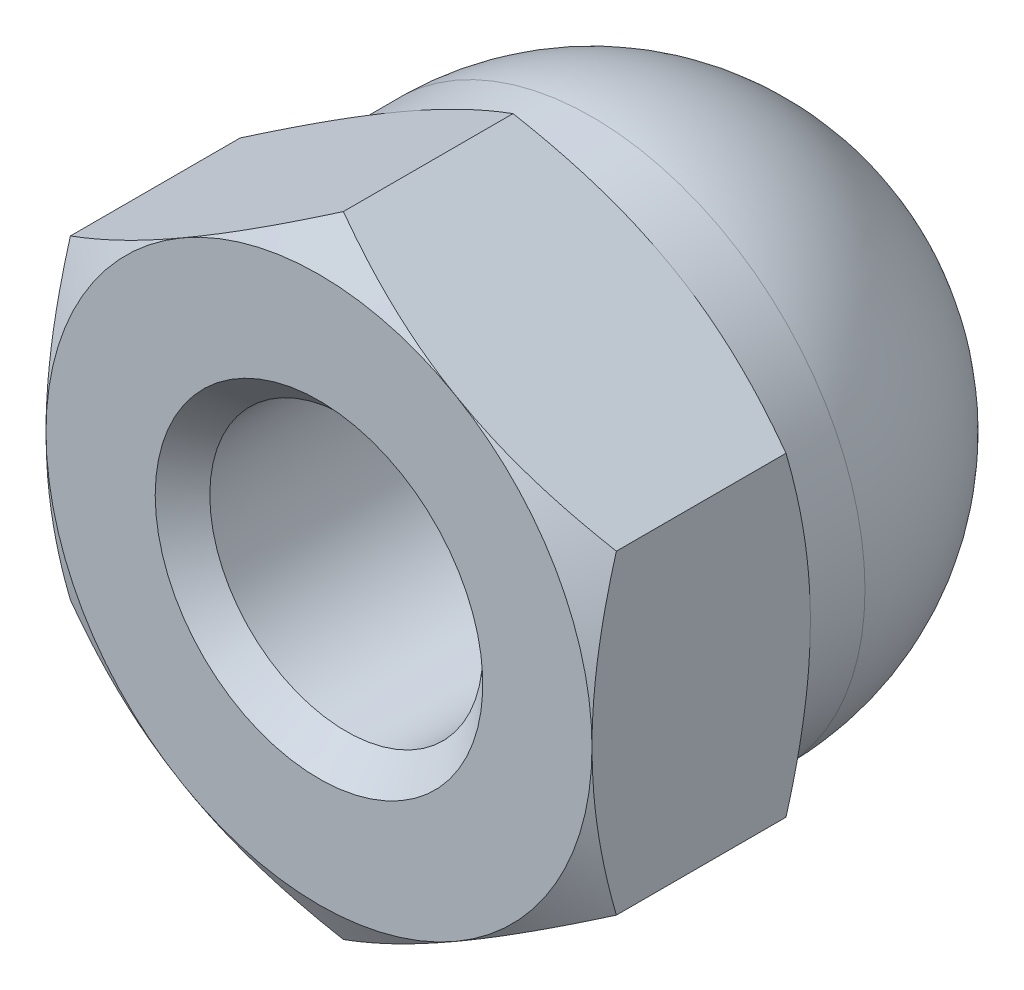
ISO-10303-21;
HEADER;
FILE_DESCRIPTION(('STEP AP214'),'2;1');
FILE_NAME('part.step','',(''),(''),'','','');
FILE_SCHEMA(('AUTOMOTIVE_DESIGN { 1 0 10303 214 1 1 1 1 }'));
ENDSEC;
DATA;
#1=APPLICATION_CONTEXT('core data for automotive mechanical design processes');
#2=APPLICATION_PROTOCOL_DEFINITION('international standard','automotive_design',2000,#1);
#3=PRODUCT_CONTEXT('',#1,'mechanical');
#4=PRODUCT('Part','Part','',(#3));
#5=PRODUCT_RELATED_PRODUCT_CATEGORY('part','',(#4));
#6=PRODUCT_DEFINITION_FORMATION('','',#4);
#7=PRODUCT_DEFINITION_CONTEXT('part definition',#1,'design');
#8=PRODUCT_DEFINITION('design','',#6,#7);
#9=PRODUCT_DEFINITION_SHAPE('','',#8);
#10=(LENGTH_UNIT() NAMED_UNIT(*) SI_UNIT(.MILLI.,.METRE.));
#11=(NAMED_UNIT(*) PLANE_ANGLE_UNIT() SI_UNIT($,.RADIAN.));
#12=(NAMED_UNIT(*) SI_UNIT($,.STERADIAN.) SOLID_ANGLE_UNIT());
#13=UNCERTAINTY_MEASURE_WITH_UNIT(LENGTH_MEASURE(1.E-05),#10,'distance_accuracy_value','');
#14=(GEOMETRIC_REPRESENTATION_CONTEXT(3) GLOBAL_UNCERTAINTY_ASSIGNED_CONTEXT((#13)) GLOBAL_UNIT_ASSIGNED_CONTEXT((#10,
#11,#12)) REPRESENTATION_CONTEXT('',''));
#15=CARTESIAN_POINT('',(0.,0.,0.));
#16=DIRECTION('',(0.,0.,1.));
#17=DIRECTION('',(1.,0.,0.));
#18=AXIS2_PLACEMENT_3D('',#15,#16,#17);
#19=CARTESIAN_POINT('',(-5.,8.66025403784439,0.));
#20=DIRECTION('',(0.,0.,-1.));
#21=DIRECTION('',(-1.,0.,0.));
#22=AXIS2_PLACEMENT_3D('',#19,#20,#21);
#23=PLANE('',#22);
#24=CARTESIAN_POINT('',(0.,0.,0.));
#25=DIRECTION('',(0.,0.,-1.));
#26=DIRECTION('',(-1.,0.,0.));
#27=AXIS2_PLACEMENT_3D('',#24,#25,#26);
#28=CIRCLE('',#27,3.);
#29=CARTESIAN_POINT('',(-3.,0.,0.));
#30=VERTEX_POINT('',#29);
#31=EDGE_CURVE('E11',#30,#30,#28,.T.);
#32=ORIENTED_EDGE('',*,*,#31,.T.);
#33=EDGE_LOOP('',(#32));
#34=FACE_BOUND('',#33,.T.);
#35=CARTESIAN_POINT('',(0.,0.,0.));
#36=DIRECTION('',(0.,0.,-1.));
#37=DIRECTION('',(-1.,0.,0.));
#38=AXIS2_PLACEMENT_3D('',#35,#36,#37);
#39=CIRCLE('',#38,5.);
#40=CARTESIAN_POINT('',(-5.,0.,0.));
#41=VERTEX_POINT('',#40);
#42=CARTESIAN_POINT('',(-2.5,4.3301270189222,0.));
#43=VERTEX_POINT('',#42);
#44=EDGE_CURVE('E163',#41,#43,#39,.T.);
#45=ORIENTED_EDGE('',*,*,#44,.F.);
#46=CARTESIAN_POINT('',(0.,0.,0.));
#47=DIRECTION('',(0.,0.,-1.));
#48=DIRECTION('',(-1.,0.,0.));
#49=AXIS2_PLACEMENT_3D('',#46,#47,#48);
#50=CIRCLE('',#49,5.);
#51=CARTESIAN_POINT('',(-2.5,-4.3301270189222,0.));
#52=VERTEX_POINT('',#51);
#53=EDGE_CURVE('E150',#41,#52,#50,.F.);
#54=ORIENTED_EDGE('',*,*,#53,.T.);
#55=CARTESIAN_POINT('',(2.5,-4.3301270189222,0.));
#56=VERTEX_POINT('',#55);
#57=EDGE_CURVE('E303',#52,#56,#50,.F.);
#58=ORIENTED_EDGE('',*,*,#57,.T.);
#59=CARTESIAN_POINT('',(5.,0.,0.));
#60=VERTEX_POINT('',#59);
#61=EDGE_CURVE('E377',#56,#60,#50,.F.);
#62=ORIENTED_EDGE('',*,*,#61,.T.);
#63=CARTESIAN_POINT('',(2.5,4.3301270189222,0.));
#64=VERTEX_POINT('',#63);
#65=EDGE_CURVE('E378',#60,#64,#50,.F.);
#66=ORIENTED_EDGE('',*,*,#65,.T.);
#67=EDGE_CURVE('E279',#64,#43,#50,.F.);
#68=ORIENTED_EDGE('',*,*,#67,.T.);
#69=EDGE_LOOP('',(#45,#54,#58,#62,#66,#68));
#70=FACE_BOUND('',#69,.T.);
#71=ADVANCED_FACE('F37',(#34,#70),#23,.F.);
#72=CARTESIAN_POINT('',(0.,0.,0.));
#73=DIRECTION('',(0.,0.,-1.));
#74=DIRECTION('',(-1.,0.,0.));
#75=AXIS2_PLACEMENT_3D('',#72,#73,#74);
#76=CONICAL_SURFACE('',#75,5.,1.0471975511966);
#77=CARTESIAN_POINT('',(-5.,-7.87365701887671,-2.49824245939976));
#78=CARTESIAN_POINT('',(-5.,-7.65424885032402,-2.39133489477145));
#79=CARTESIAN_POINT('',(-5.,-7.43434967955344,-2.28541837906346));
#80=CARTESIAN_POINT('',(-5.,-6.99330867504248,-2.07612251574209));
#81=CARTESIAN_POINT('',(-5.,-6.77216666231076,-1.97274354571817));
#82=CARTESIAN_POINT('',(-5.,-6.32729608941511,-1.76858296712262));
#83=CARTESIAN_POINT('',(-5.,-6.10356006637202,-1.66781756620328));
#84=CARTESIAN_POINT('',(-5.,-5.6543498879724,-1.47025361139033));
#85=CARTESIAN_POINT('',(-5.,-5.42887581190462,-1.37345487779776));
#86=CARTESIAN_POINT('',(-5.,-4.9680971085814,-1.1816480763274));
#87=CARTESIAN_POINT('',(-5.,-4.73271967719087,-1.08681398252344));
#88=CARTESIAN_POINT('',(-5.,-4.25925541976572,-0.904038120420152));
#89=CARTESIAN_POINT('',(-5.,-4.02116829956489,-0.8160971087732));
#90=CARTESIAN_POINT('',(-5.,-3.54231432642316,-0.649328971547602));
#91=CARTESIAN_POINT('',(-5.,-3.30155361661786,-0.570484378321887));
#92=CARTESIAN_POINT('',(-5.,-2.81658011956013,-0.424359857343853));
#93=CARTESIAN_POINT('',(-5.,-2.57236840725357,-0.357076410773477));
#94=CARTESIAN_POINT('',(-5.,-2.08174046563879,-0.237589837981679));
#95=CARTESIAN_POINT('',(-5.,-1.83534566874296,-0.18530029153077));
#96=CARTESIAN_POINT('',(-5.,-1.33936997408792,-0.0986667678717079));
#97=CARTESIAN_POINT('',(-5.,-1.08978941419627,-0.0643209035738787));
#98=CARTESIAN_POINT('',(-5.,-0.591995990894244,-0.0167583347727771));
#99=CARTESIAN_POINT('',(-5.,-0.343810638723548,-0.00326081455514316));
#100=CARTESIAN_POINT('',(-5.,0.15282167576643,0.00220791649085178));
#101=CARTESIAN_POINT('',(-5.,0.401268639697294,-0.00582100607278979));
#102=CARTESIAN_POINT('',(-5.,0.819594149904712,-0.0368840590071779));
#103=CARTESIAN_POINT('',(-5.,0.989903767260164,-0.0544819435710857));
#104=CARTESIAN_POINT('',(-5.,1.32934599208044,-0.0987603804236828));
#105=CARTESIAN_POINT('',(-5.,1.49847844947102,-0.125442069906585));
#106=CARTESIAN_POINT('',(-5.,2.00384655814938,-0.217717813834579));
#107=CARTESIAN_POINT('',(-5.,2.33788035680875,-0.295527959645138));
#108=CARTESIAN_POINT('',(-5.,2.83751062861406,-0.431339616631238));
#109=CARTESIAN_POINT('',(-5.,3.00567281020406,-0.480447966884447));
#110=CARTESIAN_POINT('',(-5.,3.34036615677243,-0.583987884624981));
#111=CARTESIAN_POINT('',(-5.,3.506897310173,-0.638419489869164));
#112=CARTESIAN_POINT('',(-5.,3.83837706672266,-0.751714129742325));
#113=CARTESIAN_POINT('',(-5.,4.00332611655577,-0.810575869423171));
#114=CARTESIAN_POINT('',(-5.,4.33184285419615,-0.932016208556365));
#115=CARTESIAN_POINT('',(-5.,4.49541056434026,-0.994594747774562));
#116=CARTESIAN_POINT('',(-5.,4.90340399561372,-1.15516084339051));
#117=CARTESIAN_POINT('',(-5.,5.14705792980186,-1.25510669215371));
#118=CARTESIAN_POINT('',(-5.,5.63208625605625,-1.46040212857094));
#119=CARTESIAN_POINT('',(-5.,5.87346045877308,-1.56575216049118));
#120=CARTESIAN_POINT('',(-5.,6.35438607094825,-1.78069088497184));
#121=CARTESIAN_POINT('',(-5.,6.59393697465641,-1.89028070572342));
#122=CARTESIAN_POINT('',(-5.,7.07149214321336,-2.11278643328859));
#123=CARTESIAN_POINT('',(-5.,7.3094963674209,-2.22570242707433));
#124=CARTESIAN_POINT('',(-5.,7.78453532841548,-2.45433961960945));
#125=CARTESIAN_POINT('',(-5.,8.02156838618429,-2.57006430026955));
#126=CARTESIAN_POINT('',(-5.,8.49456959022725,-2.80367203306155));
#127=CARTESIAN_POINT('',(-5.,8.73053772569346,-2.92155510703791));
#128=CARTESIAN_POINT('',(-5.,9.43703462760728,-3.27778987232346));
#129=CARTESIAN_POINT('',(-5.,9.90623897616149,-3.51876746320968));
#130=CARTESIAN_POINT('',(-5.,10.7985198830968,-3.9828522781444));
#131=CARTESIAN_POINT('',(-5.,11.2218199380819,-4.20553183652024));
#132=CARTESIAN_POINT('',(-5.,12.0668775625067,-4.65384433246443));
#133=CARTESIAN_POINT('',(-5.,12.4886350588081,-4.8794774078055));
#134=CARTESIAN_POINT('',(-5.,13.3297110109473,-5.33229431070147));
#135=CARTESIAN_POINT('',(-5.,13.7490329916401,-5.55947160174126));
#136=CARTESIAN_POINT('',(-5.,14.5867026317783,-6.01555026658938));
#137=CARTESIAN_POINT('',(-5.,15.0050503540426,-6.24445152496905));
#138=CARTESIAN_POINT('',(-5.,15.4230465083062,-6.47398871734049));
#139=B_SPLINE_CURVE_WITH_KNOTS('',3,(#77,#78,#79,#80,#81,#82,#83,#84,#85,#86,#87,#88,#89,#90,
#91,#92,#93,#94,#95,#96,#97,#98,#99,#100,#101,#102,#103,#104,#105,#106,#107,#108,#109,#110,#111,
#112,#113,#114,#115,#116,#117,#118,#119,#120,#121,#122,#123,#124,#125,#126,#127,#128,#129,#130,
#131,#132,#133,#134,#135,#136,#137,#138),.UNSPECIFIED.,.F.,.F.,(4,2,2,2,2,2,2,2,2,2,2,2,2,2,2,2,
2,2,2,2,2,2,2,2,2,2,2,2,2,2,4),(0.,0.732212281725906,1.46453286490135,2.20064275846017,
2.9367192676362,3.69792700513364,4.45921818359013,5.21902224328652,5.97859463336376,
6.73369679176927,7.48871952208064,8.23348098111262,8.97824705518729,9.49164933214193,
10.0051159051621,11.0325662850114,11.5580766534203,12.0835907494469,12.6089518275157,
13.1343043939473,13.9242808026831,14.7143222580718,15.5045754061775,16.2948492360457,
17.0861585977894,17.8774759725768,19.4598336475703,20.8947158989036,22.3296653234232,
23.760382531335,25.1910047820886),.UNSPECIFIED.);
#140=CARTESIAN_POINT('',(-5.,2.88675134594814,-0.446581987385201));
#141=VERTEX_POINT('',#140);
#142=EDGE_CURVE('E181',#141,#41,#139,.F.);
#143=ORIENTED_EDGE('',*,*,#142,.T.);
#144=ORIENTED_EDGE('',*,*,#44,.T.);
#145=CARTESIAN_POINT('',(0.0002,5.7736181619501,-0.446648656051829));
#146=CARTESIAN_POINT('',(-0.219534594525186,5.64675433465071,-0.373386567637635));
#147=CARTESIAN_POINT('',(-0.441148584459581,5.5188054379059,-0.306751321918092));
#148=CARTESIAN_POINT('',(-0.888213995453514,5.26069210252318,-0.190438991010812));
#149=CARTESIAN_POINT('',(-1.11367335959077,5.13052307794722,-0.140803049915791));
#150=CARTESIAN_POINT('',(-1.56183230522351,4.87177839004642,-0.0635510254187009));
#151=CARTESIAN_POINT('',(-1.78446209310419,4.74324302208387,-0.0354203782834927));
#152=CARTESIAN_POINT('',(-2.11918990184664,4.54998783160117,-0.0101949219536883));
#153=CARTESIAN_POINT('',(-2.23084219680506,4.48552534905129,-0.00461345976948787));
#154=CARTESIAN_POINT('',(-2.4542499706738,4.35654081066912,0.000797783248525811));
#155=CARTESIAN_POINT('',(-2.56600544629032,4.29201875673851,0.000627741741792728));
#156=CARTESIAN_POINT('',(-2.87218423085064,4.11524635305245,-0.00775363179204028));
#157=CARTESIAN_POINT('',(-3.06650608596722,4.00305457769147,-0.0218297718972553));
#158=CARTESIAN_POINT('',(-3.45386010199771,3.77941563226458,-0.0664652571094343));
#159=CARTESIAN_POINT('',(-3.64689090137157,3.66796924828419,-0.0970398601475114));
#160=CARTESIAN_POINT('',(-4.03502534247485,3.44387972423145,-0.173468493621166));
#161=CARTESIAN_POINT('',(-4.23007999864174,3.33126486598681,-0.219646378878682));
#162=CARTESIAN_POINT('',(-4.61728034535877,3.10771464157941,-0.324451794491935));
#163=CARTESIAN_POINT('',(-4.80943099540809,2.99677641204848,-0.383054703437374));
#164=CARTESIAN_POINT('',(-5.0002,2.8866358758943,-0.446648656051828));
#165=B_SPLINE_CURVE_WITH_KNOTS('',3,(#145,#146,#147,#148,#149,#150,#151,#152,#153,#154,#155,
#156,#157,#158,#159,#160,#161,#162,#163,#164),.UNSPECIFIED.,.F.,.F.,(4,2,2,2,2,2,2,2,2,4),(0.,
0.79255584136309,1.58701660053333,2.3618153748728,2.74884076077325,3.13585419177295,
3.80962362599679,4.48401723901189,5.17336882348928,5.86136694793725),.UNSPECIFIED.);
#166=EDGE_CURVE('E167',#43,#141,#165,.T.);
#167=ORIENTED_EDGE('',*,*,#166,.T.);
#168=EDGE_LOOP('',(#143,#144,#167));
#169=FACE_BOUND('',#168,.T.);
#170=ADVANCED_FACE('F188',(#169),#76,.T.);
#171=CARTESIAN_POINT('',(5.0002,2.8866358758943,-0.446648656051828));
#172=CARTESIAN_POINT('',(4.78046540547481,3.01349970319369,-0.373386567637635));
#173=CARTESIAN_POINT('',(4.55885141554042,3.1414485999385,-0.306751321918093));
#174=CARTESIAN_POINT('',(4.11178600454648,3.39956193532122,-0.190438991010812));
#175=CARTESIAN_POINT('',(3.88632664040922,3.52973095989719,-0.140803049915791));
#176=CARTESIAN_POINT('',(3.43816769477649,3.78847564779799,-0.0635510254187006));
#177=CARTESIAN_POINT('',(3.21553790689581,3.91701101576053,-0.0354203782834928));
#178=CARTESIAN_POINT('',(2.88081009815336,4.11026620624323,-0.0101949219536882));
#179=CARTESIAN_POINT('',(2.76915780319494,4.17472868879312,-0.00461345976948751));
#180=CARTESIAN_POINT('',(2.5457500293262,4.30371322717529,0.000797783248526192));
#181=CARTESIAN_POINT('',(2.43399455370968,4.3682352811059,0.000627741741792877));
#182=CARTESIAN_POINT('',(2.12781576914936,4.54500768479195,-0.00775363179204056));
#183=CARTESIAN_POINT('',(1.93349391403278,4.65719946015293,-0.0218297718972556));
#184=CARTESIAN_POINT('',(1.54613989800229,4.88083840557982,-0.0664652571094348));
#185=CARTESIAN_POINT('',(1.35310909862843,4.99228478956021,-0.0970398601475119));
#186=CARTESIAN_POINT('',(0.964974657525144,5.21637431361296,-0.173468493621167));
#187=CARTESIAN_POINT('',(0.769920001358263,5.32898917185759,-0.219646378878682));
#188=CARTESIAN_POINT('',(0.382719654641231,5.55253939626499,-0.324451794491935));
#189=CARTESIAN_POINT('',(0.190569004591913,5.66347762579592,-0.383054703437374));
#190=CARTESIAN_POINT('',(-0.000200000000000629,5.7736181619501,-0.446648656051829));
#191=B_SPLINE_CURVE_WITH_KNOTS('',3,(#171,#172,#173,#174,#175,#176,#177,#178,#179,#180,#181,
#182,#183,#184,#185,#186,#187,#188,#189,#190),.UNSPECIFIED.,.F.,.F.,(4,2,2,2,2,2,2,2,2,4),(0.,
0.792555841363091,1.58701660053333,2.36181537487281,2.74884076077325,3.13585419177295,
3.80962362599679,4.48401723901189,5.17336882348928,5.86136694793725),.UNSPECIFIED.);
#192=CARTESIAN_POINT('',(0.,5.77350269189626,-0.446581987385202));
#193=VERTEX_POINT('',#192);
#194=EDGE_CURVE('E206',#64,#193,#191,.T.);
#195=ORIENTED_EDGE('',*,*,#194,.T.);
#196=EDGE_CURVE('E180',#193,#43,#165,.T.);
#197=ORIENTED_EDGE('',*,*,#196,.T.);
#198=ORIENTED_EDGE('',*,*,#67,.F.);
#199=EDGE_LOOP('',(#195,#197,#198));
#200=FACE_BOUND('',#199,.T.);
#201=ADVANCED_FACE('F193',(#200),#76,.T.);
#202=CARTESIAN_POINT('',(5.,-7.87365701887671,-2.49824245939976));
#203=CARTESIAN_POINT('',(5.,-7.65424885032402,-2.39133489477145));
#204=CARTESIAN_POINT('',(5.,-7.43434967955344,-2.28541837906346));
#205=CARTESIAN_POINT('',(5.,-6.99330867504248,-2.07612251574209));
#206=CARTESIAN_POINT('',(5.,-6.77216666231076,-1.97274354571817));
#207=CARTESIAN_POINT('',(5.,-6.32729608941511,-1.76858296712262));
#208=CARTESIAN_POINT('',(5.,-6.10356006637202,-1.66781756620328));
#209=CARTESIAN_POINT('',(5.,-5.6543498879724,-1.47025361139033));
#210=CARTESIAN_POINT('',(5.,-5.42887581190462,-1.37345487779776));
#211=CARTESIAN_POINT('',(5.,-4.9680971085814,-1.1816480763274));
#212=CARTESIAN_POINT('',(5.,-4.73271967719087,-1.08681398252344));
#213=CARTESIAN_POINT('',(5.,-4.25925541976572,-0.904038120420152));
#214=CARTESIAN_POINT('',(5.,-4.02116829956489,-0.8160971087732));
#215=CARTESIAN_POINT('',(5.,-3.54231432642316,-0.649328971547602));
#216=CARTESIAN_POINT('',(5.,-3.30155361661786,-0.570484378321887));
#217=CARTESIAN_POINT('',(5.,-2.81658011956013,-0.424359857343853));
#218=CARTESIAN_POINT('',(5.,-2.57236840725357,-0.357076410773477));
#219=CARTESIAN_POINT('',(5.,-2.08174046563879,-0.237589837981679));
#220=CARTESIAN_POINT('',(5.,-1.83534566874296,-0.18530029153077));
#221=CARTESIAN_POINT('',(5.,-1.33936997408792,-0.0986667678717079));
#222=CARTESIAN_POINT('',(5.,-1.08978941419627,-0.0643209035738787));
#223=CARTESIAN_POINT('',(5.,-0.591995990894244,-0.0167583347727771));
#224=CARTESIAN_POINT('',(5.,-0.343810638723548,-0.00326081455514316));
#225=CARTESIAN_POINT('',(5.,0.15282167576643,0.00220791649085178));
#226=CARTESIAN_POINT('',(5.,0.401268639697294,-0.00582100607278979));
#227=CARTESIAN_POINT('',(5.,0.819594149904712,-0.0368840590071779));
#228=CARTESIAN_POINT('',(5.,0.989903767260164,-0.0544819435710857));
#229=CARTESIAN_POINT('',(5.,1.32934599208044,-0.0987603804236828));
#230=CARTESIAN_POINT('',(5.,1.49847844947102,-0.125442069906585));
#231=CARTESIAN_POINT('',(5.,2.00384655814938,-0.217717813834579));
#232=CARTESIAN_POINT('',(5.,2.33788035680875,-0.295527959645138));
#233=CARTESIAN_POINT('',(5.,2.83751062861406,-0.431339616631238));
#234=CARTESIAN_POINT('',(5.,3.00567281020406,-0.480447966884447));
#235=CARTESIAN_POINT('',(5.,3.34036615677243,-0.583987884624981));
#236=CARTESIAN_POINT('',(5.,3.506897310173,-0.638419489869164));
#237=CARTESIAN_POINT('',(5.,3.83837706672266,-0.751714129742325));
#238=CARTESIAN_POINT('',(5.,4.00332611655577,-0.810575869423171));
#239=CARTESIAN_POINT('',(5.,4.33184285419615,-0.932016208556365));
#240=CARTESIAN_POINT('',(5.,4.49541056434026,-0.994594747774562));
#241=CARTESIAN_POINT('',(5.,4.90340399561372,-1.15516084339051));
#242=CARTESIAN_POINT('',(5.,5.14705792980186,-1.25510669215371));
#243=CARTESIAN_POINT('',(5.,5.63208625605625,-1.46040212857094));
#244=CARTESIAN_POINT('',(5.,5.87346045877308,-1.56575216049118));
#245=CARTESIAN_POINT('',(5.,6.35438607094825,-1.78069088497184));
#246=CARTESIAN_POINT('',(5.,6.59393697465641,-1.89028070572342));
#247=CARTESIAN_POINT('',(5.,7.07149214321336,-2.11278643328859));
#248=CARTESIAN_POINT('',(5.,7.3094963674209,-2.22570242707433));
#249=CARTESIAN_POINT('',(5.,7.78453532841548,-2.45433961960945));
#250=CARTESIAN_POINT('',(5.,8.02156838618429,-2.57006430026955));
#251=CARTESIAN_POINT('',(5.,8.49456959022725,-2.80367203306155));
#252=CARTESIAN_POINT('',(5.,8.73053772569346,-2.92155510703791));
#253=CARTESIAN_POINT('',(5.,9.43703462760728,-3.27778987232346));
#254=CARTESIAN_POINT('',(5.,9.90623897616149,-3.51876746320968));
#255=CARTESIAN_POINT('',(5.,10.7985198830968,-3.9828522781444));
#256=CARTESIAN_POINT('',(5.,11.2218199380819,-4.20553183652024));
#257=CARTESIAN_POINT('',(5.,12.0668775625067,-4.65384433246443));
#258=CARTESIAN_POINT('',(5.,12.4886350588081,-4.8794774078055));
#259=CARTESIAN_POINT('',(5.,13.3297110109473,-5.33229431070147));
#260=CARTESIAN_POINT('',(5.,13.7490329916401,-5.55947160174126));
#261=CARTESIAN_POINT('',(5.,14.5867026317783,-6.01555026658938));
#262=CARTESIAN_POINT('',(5.,15.0050503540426,-6.24445152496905));
#263=CARTESIAN_POINT('',(5.,15.4230465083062,-6.47398871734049));
#264=B_SPLINE_CURVE_WITH_KNOTS('',3,(#202,#203,#204,#205,#206,#207,#208,#209,#210,#211,#212,
#213,#214,#215,#216,#217,#218,#219,#220,#221,#222,#223,#224,#225,#226,#227,#228,#229,#230,#231,
#232,#233,#234,#235,#236,#237,#238,#239,#240,#241,#242,#243,#244,#245,#246,#247,#248,#249,#250,
#251,#252,#253,#254,#255,#256,#257,#258,#259,#260,#261,#262,#263),.UNSPECIFIED.,.F.,.F.,(4,2,2,
2,2,2,2,2,2,2,2,2,2,2,2,2,2,2,2,2,2,2,2,2,2,2,2,2,2,2,4),(0.,0.732212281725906,1.46453286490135,
2.20064275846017,2.9367192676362,3.69792700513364,4.45921818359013,5.21902224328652,
5.97859463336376,6.73369679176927,7.48871952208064,8.23348098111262,8.97824705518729,
9.49164933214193,10.0051159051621,11.0325662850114,11.5580766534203,12.0835907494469,
12.6089518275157,13.1343043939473,13.9242808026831,14.7143222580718,15.5045754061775,
16.2948492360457,17.0861585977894,17.8774759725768,19.4598336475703,20.8947158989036,
22.3296653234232,23.760382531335,25.1910047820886),.UNSPECIFIED.);
#265=CARTESIAN_POINT('',(5.,2.88675134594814,-0.446581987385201));
#266=VERTEX_POINT('',#265);
#267=EDGE_CURVE('E217',#60,#266,#264,.T.);
#268=ORIENTED_EDGE('',*,*,#267,.T.);
#269=EDGE_CURVE('E291',#266,#64,#191,.T.);
#270=ORIENTED_EDGE('',*,*,#269,.T.);
#271=ORIENTED_EDGE('',*,*,#65,.F.);
#272=EDGE_LOOP('',(#268,#270,#271));
#273=FACE_BOUND('',#272,.T.);
#274=ADVANCED_FACE('F265',(#273),#76,.T.);
#275=CARTESIAN_POINT('',(-0.0002,-5.7736181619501,-0.446648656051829));
#276=CARTESIAN_POINT('',(0.219534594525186,-5.64675433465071,-0.373386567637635));
#277=CARTESIAN_POINT('',(0.441148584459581,-5.5188054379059,-0.306751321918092));
#278=CARTESIAN_POINT('',(0.888213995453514,-5.26069210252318,-0.190438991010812));
#279=CARTESIAN_POINT('',(1.11367335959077,-5.13052307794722,-0.140803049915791));
#280=CARTESIAN_POINT('',(1.56183230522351,-4.87177839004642,-0.0635510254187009));
#281=CARTESIAN_POINT('',(1.78446209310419,-4.74324302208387,-0.0354203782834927));
#282=CARTESIAN_POINT('',(2.11918990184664,-4.54998783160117,-0.0101949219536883));
#283=CARTESIAN_POINT('',(2.23084219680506,-4.48552534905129,-0.00461345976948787));
#284=CARTESIAN_POINT('',(2.4542499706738,-4.35654081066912,0.000797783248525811));
#285=CARTESIAN_POINT('',(2.56600544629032,-4.29201875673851,0.000627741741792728));
#286=CARTESIAN_POINT('',(2.87218423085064,-4.11524635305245,-0.00775363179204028));
#287=CARTESIAN_POINT('',(3.06650608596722,-4.00305457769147,-0.0218297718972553));
#288=CARTESIAN_POINT('',(3.45386010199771,-3.77941563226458,-0.0664652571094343));
#289=CARTESIAN_POINT('',(3.64689090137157,-3.66796924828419,-0.0970398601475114));
#290=CARTESIAN_POINT('',(4.03502534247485,-3.44387972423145,-0.173468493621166));
#291=CARTESIAN_POINT('',(4.23007999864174,-3.33126486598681,-0.219646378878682));
#292=CARTESIAN_POINT('',(4.61728034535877,-3.10771464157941,-0.324451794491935));
#293=CARTESIAN_POINT('',(4.80943099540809,-2.99677641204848,-0.383054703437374));
#294=CARTESIAN_POINT('',(5.0002,-2.8866358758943,-0.446648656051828));
#295=B_SPLINE_CURVE_WITH_KNOTS('',3,(#275,#276,#277,#278,#279,#280,#281,#282,#283,#284,#285,
#286,#287,#288,#289,#290,#291,#292,#293,#294),.UNSPECIFIED.,.F.,.F.,(4,2,2,2,2,2,2,2,2,4),(0.,
0.79255584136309,1.58701660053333,2.3618153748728,2.74884076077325,3.13585419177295,
3.80962362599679,4.48401723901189,5.17336882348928,5.86136694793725),.UNSPECIFIED.);
#296=CARTESIAN_POINT('',(5.,-2.88675134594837,-0.446581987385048));
#297=VERTEX_POINT('',#296);
#298=EDGE_CURVE('E223',#56,#297,#295,.T.);
#299=ORIENTED_EDGE('',*,*,#298,.T.);
#300=EDGE_CURVE('E222',#297,#60,#264,.T.);
#301=ORIENTED_EDGE('',*,*,#300,.T.);
#302=ORIENTED_EDGE('',*,*,#61,.F.);
#303=EDGE_LOOP('',(#299,#301,#302));
#304=FACE_BOUND('',#303,.T.);
#305=ADVANCED_FACE('F393',(#304),#76,.T.);
#306=CARTESIAN_POINT('',(0.,-5.77350269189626,-0.446581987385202));
#307=VERTEX_POINT('',#306);
#308=EDGE_CURVE('E139',#307,#56,#295,.T.);
#309=ORIENTED_EDGE('',*,*,#308,.T.);
#310=ORIENTED_EDGE('',*,*,#57,.F.);
#311=CARTESIAN_POINT('',(-5.0002,-2.8866358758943,-0.446648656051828));
#312=CARTESIAN_POINT('',(-4.78046540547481,-3.01349970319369,-0.373386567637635));
#313=CARTESIAN_POINT('',(-4.55885141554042,-3.1414485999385,-0.306751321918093));
#314=CARTESIAN_POINT('',(-4.11178600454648,-3.39956193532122,-0.190438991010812));
#315=CARTESIAN_POINT('',(-3.88632664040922,-3.52973095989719,-0.140803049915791));
#316=CARTESIAN_POINT('',(-3.43816769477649,-3.78847564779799,-0.0635510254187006));
#317=CARTESIAN_POINT('',(-3.21553790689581,-3.91701101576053,-0.0354203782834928));
#318=CARTESIAN_POINT('',(-2.88081009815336,-4.11026620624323,-0.0101949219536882));
#319=CARTESIAN_POINT('',(-2.76915780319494,-4.17472868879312,-0.00461345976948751));
#320=CARTESIAN_POINT('',(-2.5457500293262,-4.30371322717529,0.000797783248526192));
#321=CARTESIAN_POINT('',(-2.43399455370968,-4.3682352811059,0.000627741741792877));
#322=CARTESIAN_POINT('',(-2.12781576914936,-4.54500768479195,-0.00775363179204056));
#323=CARTESIAN_POINT('',(-1.93349391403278,-4.65719946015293,-0.0218297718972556));
#324=CARTESIAN_POINT('',(-1.54613989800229,-4.88083840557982,-0.0664652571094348));
#325=CARTESIAN_POINT('',(-1.35310909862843,-4.99228478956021,-0.0970398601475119));
#326=CARTESIAN_POINT('',(-0.964974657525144,-5.21637431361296,-0.173468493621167));
#327=CARTESIAN_POINT('',(-0.769920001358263,-5.32898917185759,-0.219646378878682));
#328=CARTESIAN_POINT('',(-0.382719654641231,-5.55253939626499,-0.324451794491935));
#329=CARTESIAN_POINT('',(-0.190569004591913,-5.66347762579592,-0.383054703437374));
#330=CARTESIAN_POINT('',(0.000200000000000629,-5.7736181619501,-0.446648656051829));
#331=B_SPLINE_CURVE_WITH_KNOTS('',3,(#311,#312,#313,#314,#315,#316,#317,#318,#319,#320,#321,
#322,#323,#324,#325,#326,#327,#328,#329,#330),.UNSPECIFIED.,.F.,.F.,(4,2,2,2,2,2,2,2,2,4),(0.,
0.792555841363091,1.58701660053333,2.36181537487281,2.74884076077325,3.13585419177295,
3.80962362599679,4.48401723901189,5.17336882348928,5.86136694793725),.UNSPECIFIED.);
#332=EDGE_CURVE('E292',#52,#307,#331,.T.);
#333=ORIENTED_EDGE('',*,*,#332,.T.);
#334=EDGE_LOOP('',(#309,#310,#333));
#335=FACE_BOUND('',#334,.T.);
#336=ADVANCED_FACE('F195',(#335),#76,.T.);
#337=CARTESIAN_POINT('',(-5.,-2.88675134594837,-0.446581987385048));
#338=VERTEX_POINT('',#337);
#339=EDGE_CURVE('E211',#338,#52,#331,.T.);
#340=ORIENTED_EDGE('',*,*,#339,.T.);
#341=ORIENTED_EDGE('',*,*,#53,.F.);
#342=EDGE_CURVE('E285',#41,#338,#139,.F.);
#343=ORIENTED_EDGE('',*,*,#342,.T.);
#344=EDGE_LOOP('',(#340,#341,#343));
#345=FACE_BOUND('',#344,.T.);
#346=ADVANCED_FACE('F258',(#345),#76,.T.);
#347=CARTESIAN_POINT('',(5.,2.88675134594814,-4.));
#348=DIRECTION('',(0.499999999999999,0.866025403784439,0.));
#349=DIRECTION('',(-0.866025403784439,0.499999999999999,0.));
#350=AXIS2_PLACEMENT_3D('',#347,#348,#349);
#351=PLANE('',#350);
#352=CARTESIAN_POINT('',(-0.000199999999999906,5.7736181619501,-3.55335134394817));
#353=CARTESIAN_POINT('',(0.219534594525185,5.64675433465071,-3.62661343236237));
#354=CARTESIAN_POINT('',(0.441148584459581,5.5188054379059,-3.69324867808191));
#355=CARTESIAN_POINT('',(0.888213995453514,5.26069210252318,-3.80956100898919));
#356=CARTESIAN_POINT('',(1.11367335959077,5.13052307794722,-3.85919695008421));
#357=CARTESIAN_POINT('',(1.56183230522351,4.87177839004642,-3.9364489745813));
#358=CARTESIAN_POINT('',(1.78446209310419,4.74324302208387,-3.96457962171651));
#359=CARTESIAN_POINT('',(2.11918990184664,4.54998783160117,-3.98980507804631));
#360=CARTESIAN_POINT('',(2.23084219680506,4.48552534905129,-3.99538654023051));
#361=CARTESIAN_POINT('',(2.4542499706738,4.35654081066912,-4.00079778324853));
#362=CARTESIAN_POINT('',(2.56600544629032,4.29201875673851,-4.00062774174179));
#363=CARTESIAN_POINT('',(2.87218423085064,4.11524635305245,-3.99224636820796));
#364=CARTESIAN_POINT('',(3.06650608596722,4.00305457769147,-3.97817022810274));
#365=CARTESIAN_POINT('',(3.45386010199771,3.77941563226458,-3.93353474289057));
#366=CARTESIAN_POINT('',(3.64689090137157,3.66796924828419,-3.90296013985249));
#367=CARTESIAN_POINT('',(4.03502534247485,3.44387972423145,-3.82653150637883));
#368=CARTESIAN_POINT('',(4.23007999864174,3.33126486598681,-3.78035362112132));
#369=CARTESIAN_POINT('',(4.61728034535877,3.10771464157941,-3.67554820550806));
#370=CARTESIAN_POINT('',(4.80943099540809,2.99677641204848,-3.61694529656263));
#371=CARTESIAN_POINT('',(5.0002,2.8866358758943,-3.55335134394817));
#372=B_SPLINE_CURVE_WITH_KNOTS('',3,(#352,#353,#354,#355,#356,#357,#358,#359,#360,#361,#362,
#363,#364,#365,#366,#367,#368,#369,#370,#371),.UNSPECIFIED.,.F.,.F.,(4,2,2,2,2,2,2,2,2,4),(0.,
0.792555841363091,1.58701660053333,2.3618153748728,2.74884076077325,3.13585419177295,
3.80962362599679,4.48401723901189,5.17336882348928,5.86136694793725),.UNSPECIFIED.);
#373=CARTESIAN_POINT('',(0.,5.77350269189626,-3.5534180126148));
#374=VERTEX_POINT('',#373);
#375=CARTESIAN_POINT('',(2.5,4.3301270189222,-4.));
#376=VERTEX_POINT('',#375);
#377=EDGE_CURVE('E144',#374,#376,#372,.T.);
#378=ORIENTED_EDGE('',*,*,#377,.F.);
#379=DIRECTION('',(0.,0.,1.));
#380=VECTOR('',#379,1.);
#381=CARTESIAN_POINT('',(0.,5.77350269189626,-4.));
#382=LINE('',#381,#380);
#383=EDGE_CURVE('E136',#374,#193,#382,.T.);
#384=ORIENTED_EDGE('',*,*,#383,.T.);
#385=ORIENTED_EDGE('',*,*,#194,.F.);
#386=ORIENTED_EDGE('',*,*,#269,.F.);
#387=DIRECTION('',(0.,0.,1.));
#388=VECTOR('',#387,1.);
#389=CARTESIAN_POINT('',(5.,2.88675134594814,-4.));
#390=LINE('',#389,#388);
#391=CARTESIAN_POINT('',(5.,2.88675134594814,-3.5534180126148));
#392=VERTEX_POINT('',#391);
#393=EDGE_CURVE('E254',#392,#266,#390,.T.);
#394=ORIENTED_EDGE('',*,*,#393,.F.);
#395=EDGE_CURVE('E249',#376,#392,#372,.T.);
#396=ORIENTED_EDGE('',*,*,#395,.F.);
#397=EDGE_LOOP('',(#378,#384,#385,#386,#394,#396));
#398=FACE_BOUND('',#397,.T.);
#399=ADVANCED_FACE('F232',(#398),#351,.T.);
#400=CARTESIAN_POINT('',(5.,-2.88675134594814,-4.));
#401=DIRECTION('',(1.,0.,0.));
#402=DIRECTION('',(0.,0.,-1.));
#403=AXIS2_PLACEMENT_3D('',#400,#401,#402);
#404=PLANE('',#403);
#405=CARTESIAN_POINT('',(5.,-7.87365701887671,-1.50175754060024));
#406=CARTESIAN_POINT('',(5.,-7.65424885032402,-1.60866510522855));
#407=CARTESIAN_POINT('',(5.,-7.43434967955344,-1.71458162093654));
#408=CARTESIAN_POINT('',(5.,-6.99330867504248,-1.92387748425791));
#409=CARTESIAN_POINT('',(5.,-6.77216666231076,-2.02725645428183));
#410=CARTESIAN_POINT('',(5.,-6.32729608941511,-2.23141703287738));
#411=CARTESIAN_POINT('',(5.,-6.10356006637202,-2.33218243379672));
#412=CARTESIAN_POINT('',(5.,-5.6543498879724,-2.52974638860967));
#413=CARTESIAN_POINT('',(5.,-5.42887581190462,-2.62654512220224));
#414=CARTESIAN_POINT('',(5.,-4.9680971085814,-2.8183519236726));
#415=CARTESIAN_POINT('',(5.,-4.73271967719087,-2.91318601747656));
#416=CARTESIAN_POINT('',(5.,-4.25925541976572,-3.09596187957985));
#417=CARTESIAN_POINT('',(5.,-4.02116829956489,-3.1839028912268));
#418=CARTESIAN_POINT('',(5.,-3.54231432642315,-3.3506710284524));
#419=CARTESIAN_POINT('',(5.,-3.30155361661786,-3.42951562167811));
#420=CARTESIAN_POINT('',(5.,-2.81658011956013,-3.57564014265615));
#421=CARTESIAN_POINT('',(5.,-2.57236840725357,-3.64292358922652));
#422=CARTESIAN_POINT('',(5.,-2.08174046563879,-3.76241016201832));
#423=CARTESIAN_POINT('',(5.,-1.83534566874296,-3.81469970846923));
#424=CARTESIAN_POINT('',(5.,-1.33936997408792,-3.90133323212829));
#425=CARTESIAN_POINT('',(5.,-1.08978941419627,-3.93567909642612));
#426=CARTESIAN_POINT('',(5.,-0.591995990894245,-3.98324166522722));
#427=CARTESIAN_POINT('',(5.,-0.343810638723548,-3.99673918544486));
#428=CARTESIAN_POINT('',(5.,0.15282167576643,-4.00220791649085));
#429=CARTESIAN_POINT('',(5.,0.401268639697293,-3.99417899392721));
#430=CARTESIAN_POINT('',(5.,0.819594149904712,-3.96311594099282));
#431=CARTESIAN_POINT('',(5.,0.989903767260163,-3.94551805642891));
#432=CARTESIAN_POINT('',(5.,1.32934599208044,-3.90123961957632));
#433=CARTESIAN_POINT('',(5.,1.49847844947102,-3.87455793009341));
#434=CARTESIAN_POINT('',(5.,2.00384655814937,-3.78228218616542));
#435=CARTESIAN_POINT('',(5.,2.33788035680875,-3.70447204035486));
#436=CARTESIAN_POINT('',(5.,2.83751062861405,-3.56866038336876));
#437=CARTESIAN_POINT('',(5.,3.00567281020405,-3.51955203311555));
#438=CARTESIAN_POINT('',(5.,3.34036615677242,-3.41601211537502));
#439=CARTESIAN_POINT('',(5.,3.50689731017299,-3.36158051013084));
#440=CARTESIAN_POINT('',(5.,3.83837706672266,-3.24828587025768));
#441=CARTESIAN_POINT('',(5.,4.00332611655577,-3.18942413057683));
#442=CARTESIAN_POINT('',(5.,4.33184285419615,-3.06798379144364));
#443=CARTESIAN_POINT('',(5.,4.49541056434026,-3.00540525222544));
#444=CARTESIAN_POINT('',(5.,4.90340399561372,-2.84483915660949));
#445=CARTESIAN_POINT('',(5.,5.14705792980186,-2.74489330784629));
#446=CARTESIAN_POINT('',(5.,5.63208625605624,-2.53959787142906));
#447=CARTESIAN_POINT('',(5.,5.87346045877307,-2.43424783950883));
#448=CARTESIAN_POINT('',(5.,6.35438607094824,-2.21930911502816));
#449=CARTESIAN_POINT('',(5.,6.5939369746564,-2.10971929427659));
#450=CARTESIAN_POINT('',(5.,7.07149214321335,-1.88721356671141));
#451=CARTESIAN_POINT('',(5.,7.30949636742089,-1.77429757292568));
#452=CARTESIAN_POINT('',(5.,7.78453532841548,-1.54566038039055));
#453=CARTESIAN_POINT('',(5.,8.02156838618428,-1.42993569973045));
#454=CARTESIAN_POINT('',(5.,8.49456959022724,-1.19632796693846));
#455=CARTESIAN_POINT('',(5.,8.73053772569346,-1.0784448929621));
#456=CARTESIAN_POINT('',(5.,9.43703462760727,-0.722210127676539));
#457=CARTESIAN_POINT('',(5.,9.90623897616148,-0.481232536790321));
#458=CARTESIAN_POINT('',(5.,10.7985198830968,-0.0171477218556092));
#459=CARTESIAN_POINT('',(5.,11.2218199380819,0.205531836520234));
#460=CARTESIAN_POINT('',(5.,12.0668775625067,0.653844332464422));
#461=CARTESIAN_POINT('',(5.,12.4886350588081,0.879477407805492));
#462=CARTESIAN_POINT('',(5.,13.3297110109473,1.33229431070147));
#463=CARTESIAN_POINT('',(5.,13.7490329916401,1.55947160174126));
#464=CARTESIAN_POINT('',(5.,14.5867026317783,2.01555026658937));
#465=CARTESIAN_POINT('',(5.,15.0050503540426,2.24445152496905));
#466=CARTESIAN_POINT('',(5.,15.4230465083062,2.47398871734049));
#467=B_SPLINE_CURVE_WITH_KNOTS('',3,(#405,#406,#407,#408,#409,#410,#411,#412,#413,#414,#415,
#416,#417,#418,#419,#420,#421,#422,#423,#424,#425,#426,#427,#428,#429,#430,#431,#432,#433,#434,
#435,#436,#437,#438,#439,#440,#441,#442,#443,#444,#445,#446,#447,#448,#449,#450,#451,#452,#453,
#454,#455,#456,#457,#458,#459,#460,#461,#462,#463,#464,#465,#466),.UNSPECIFIED.,.F.,.F.,(4,2,2,
2,2,2,2,2,2,2,2,2,2,2,2,2,2,2,2,2,2,2,2,2,2,2,2,2,2,2,4),(0.,0.732212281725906,1.46453286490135,
2.20064275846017,2.9367192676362,3.69792700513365,4.45921818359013,5.21902224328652,
5.97859463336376,6.73369679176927,7.48871952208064,8.23348098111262,8.97824705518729,
9.49164933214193,10.0051159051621,11.0325662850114,11.5580766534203,12.0835907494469,
12.6089518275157,13.1343043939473,13.9242808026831,14.7143222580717,15.5045754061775,
16.2948492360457,17.0861585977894,17.8774759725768,19.4598336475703,20.8947158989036,
22.3296653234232,23.760382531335,25.1910047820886),.UNSPECIFIED.);
#468=CARTESIAN_POINT('',(5.,0.,-4.));
#469=VERTEX_POINT('',#468);
#470=EDGE_CURVE('E243',#392,#469,#467,.F.);
#471=ORIENTED_EDGE('',*,*,#470,.F.);
#472=ORIENTED_EDGE('',*,*,#393,.T.);
#473=ORIENTED_EDGE('',*,*,#267,.F.);
#474=ORIENTED_EDGE('',*,*,#300,.F.);
#475=DIRECTION('',(0.,0.,1.));
#476=VECTOR('',#475,1.);
#477=CARTESIAN_POINT('',(5.,-2.88675134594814,-4.));
#478=LINE('',#477,#476);
#479=CARTESIAN_POINT('',(5.,-2.88675134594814,-3.5534180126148));
#480=VERTEX_POINT('',#479);
#481=EDGE_CURVE('E382',#480,#297,#478,.T.);
#482=ORIENTED_EDGE('',*,*,#481,.F.);
#483=EDGE_CURVE('E237',#469,#480,#467,.F.);
#484=ORIENTED_EDGE('',*,*,#483,.F.);
#485=EDGE_LOOP('',(#471,#472,#473,#474,#482,#484));
#486=FACE_BOUND('',#485,.T.);
#487=ADVANCED_FACE('F228',(#486),#404,.T.);
#488=CARTESIAN_POINT('',(5.,-2.88675134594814,-4.));
#489=DIRECTION('',(0.499999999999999,-0.866025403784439,0.));
#490=DIRECTION('',(0.866025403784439,0.499999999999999,0.));
#491=AXIS2_PLACEMENT_3D('',#488,#489,#490);
#492=PLANE('',#491);
#493=CARTESIAN_POINT('',(5.0002,-2.8866358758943,-3.55335134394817));
#494=CARTESIAN_POINT('',(4.78046540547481,-3.01349970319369,-3.62661343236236));
#495=CARTESIAN_POINT('',(4.55885141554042,-3.1414485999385,-3.69324867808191));
#496=CARTESIAN_POINT('',(4.11178600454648,-3.39956193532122,-3.80956100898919));
#497=CARTESIAN_POINT('',(3.88632664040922,-3.52973095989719,-3.85919695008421));
#498=CARTESIAN_POINT('',(3.43816769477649,-3.78847564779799,-3.9364489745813));
#499=CARTESIAN_POINT('',(3.21553790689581,-3.91701101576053,-3.96457962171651));
#500=CARTESIAN_POINT('',(2.88081009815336,-4.11026620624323,-3.98980507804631));
#501=CARTESIAN_POINT('',(2.76915780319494,-4.17472868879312,-3.99538654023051));
#502=CARTESIAN_POINT('',(2.5457500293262,-4.30371322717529,-4.00079778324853));
#503=CARTESIAN_POINT('',(2.43399455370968,-4.3682352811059,-4.00062774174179));
#504=CARTESIAN_POINT('',(2.12781576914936,-4.54500768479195,-3.99224636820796));
#505=CARTESIAN_POINT('',(1.93349391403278,-4.65719946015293,-3.97817022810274));
#506=CARTESIAN_POINT('',(1.54613989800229,-4.88083840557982,-3.93353474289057));
#507=CARTESIAN_POINT('',(1.35310909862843,-4.99228478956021,-3.90296013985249));
#508=CARTESIAN_POINT('',(0.964974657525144,-5.21637431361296,-3.82653150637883));
#509=CARTESIAN_POINT('',(0.769920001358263,-5.32898917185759,-3.78035362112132));
#510=CARTESIAN_POINT('',(0.38271965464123,-5.55253939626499,-3.67554820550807));
#511=CARTESIAN_POINT('',(0.190569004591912,-5.66347762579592,-3.61694529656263));
#512=CARTESIAN_POINT('',(-0.00020000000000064,-5.7736181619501,-3.55335134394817));
#513=B_SPLINE_CURVE_WITH_KNOTS('',3,(#493,#494,#495,#496,#497,#498,#499,#500,#501,#502,#503,
#504,#505,#506,#507,#508,#509,#510,#511,#512),.UNSPECIFIED.,.F.,.F.,(4,2,2,2,2,2,2,2,2,4),(0.,
0.792555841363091,1.58701660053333,2.36181537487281,2.74884076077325,3.13585419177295,
3.80962362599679,4.48401723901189,5.17336882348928,5.86136694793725),.UNSPECIFIED.);
#514=CARTESIAN_POINT('',(2.5,-4.3301270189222,-4.));
#515=VERTEX_POINT('',#514);
#516=EDGE_CURVE('E60',#480,#515,#513,.T.);
#517=ORIENTED_EDGE('',*,*,#516,.F.);
#518=ORIENTED_EDGE('',*,*,#481,.T.);
#519=ORIENTED_EDGE('',*,*,#298,.F.);
#520=ORIENTED_EDGE('',*,*,#308,.F.);
#521=DIRECTION('',(0.,0.,1.));
#522=VECTOR('',#521,1.);
#523=CARTESIAN_POINT('',(0.,-5.77350269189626,-4.));
#524=LINE('',#523,#522);
#525=CARTESIAN_POINT('',(0.,-5.77350269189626,-3.5534180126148));
#526=VERTEX_POINT('',#525);
#527=EDGE_CURVE('E298',#526,#307,#524,.T.);
#528=ORIENTED_EDGE('',*,*,#527,.F.);
#529=EDGE_CURVE('E244',#515,#526,#513,.T.);
#530=ORIENTED_EDGE('',*,*,#529,.F.);
#531=EDGE_LOOP('',(#517,#518,#519,#520,#528,#530));
#532=FACE_BOUND('',#531,.T.);
#533=ADVANCED_FACE('F231',(#532),#492,.T.);
#534=CARTESIAN_POINT('',(-5.,-2.88675134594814,-4.));
#535=DIRECTION('',(-0.499999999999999,-0.866025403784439,0.));
#536=DIRECTION('',(0.866025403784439,-0.499999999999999,0.));
#537=AXIS2_PLACEMENT_3D('',#534,#535,#536);
#538=PLANE('',#537);
#539=CARTESIAN_POINT('',(0.000199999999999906,-5.7736181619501,-3.55335134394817));
#540=CARTESIAN_POINT('',(-0.219534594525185,-5.64675433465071,-3.62661343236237));
#541=CARTESIAN_POINT('',(-0.441148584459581,-5.5188054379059,-3.69324867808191));
#542=CARTESIAN_POINT('',(-0.888213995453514,-5.26069210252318,-3.80956100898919));
#543=CARTESIAN_POINT('',(-1.11367335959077,-5.13052307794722,-3.85919695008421));
#544=CARTESIAN_POINT('',(-1.56183230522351,-4.87177839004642,-3.9364489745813));
#545=CARTESIAN_POINT('',(-1.78446209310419,-4.74324302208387,-3.96457962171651));
#546=CARTESIAN_POINT('',(-2.11918990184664,-4.54998783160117,-3.98980507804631));
#547=CARTESIAN_POINT('',(-2.23084219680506,-4.48552534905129,-3.99538654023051));
#548=CARTESIAN_POINT('',(-2.4542499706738,-4.35654081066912,-4.00079778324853));
#549=CARTESIAN_POINT('',(-2.56600544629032,-4.29201875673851,-4.00062774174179));
#550=CARTESIAN_POINT('',(-2.87218423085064,-4.11524635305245,-3.99224636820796));
#551=CARTESIAN_POINT('',(-3.06650608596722,-4.00305457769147,-3.97817022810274));
#552=CARTESIAN_POINT('',(-3.45386010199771,-3.77941563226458,-3.93353474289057));
#553=CARTESIAN_POINT('',(-3.64689090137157,-3.66796924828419,-3.90296013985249));
#554=CARTESIAN_POINT('',(-4.03502534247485,-3.44387972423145,-3.82653150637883));
#555=CARTESIAN_POINT('',(-4.23007999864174,-3.33126486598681,-3.78035362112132));
#556=CARTESIAN_POINT('',(-4.61728034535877,-3.10771464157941,-3.67554820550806));
#557=CARTESIAN_POINT('',(-4.80943099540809,-2.99677641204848,-3.61694529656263));
#558=CARTESIAN_POINT('',(-5.0002,-2.8866358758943,-3.55335134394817));
#559=B_SPLINE_CURVE_WITH_KNOTS('',3,(#539,#540,#541,#542,#543,#544,#545,#546,#547,#548,#549,
#550,#551,#552,#553,#554,#555,#556,#557,#558),.UNSPECIFIED.,.F.,.F.,(4,2,2,2,2,2,2,2,2,4),(0.,
0.792555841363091,1.58701660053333,2.3618153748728,2.74884076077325,3.13585419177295,
3.80962362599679,4.48401723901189,5.17336882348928,5.86136694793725),.UNSPECIFIED.);
#560=CARTESIAN_POINT('',(-2.5,-4.3301270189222,-4.));
#561=VERTEX_POINT('',#560);
#562=EDGE_CURVE('E52',#526,#561,#559,.T.);
#563=ORIENTED_EDGE('',*,*,#562,.F.);
#564=ORIENTED_EDGE('',*,*,#527,.T.);
#565=ORIENTED_EDGE('',*,*,#332,.F.);
#566=ORIENTED_EDGE('',*,*,#339,.F.);
#567=DIRECTION('',(0.,0.,1.));
#568=VECTOR('',#567,1.);
#569=CARTESIAN_POINT('',(-5.,-2.88675134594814,-4.));
#570=LINE('',#569,#568);
#571=CARTESIAN_POINT('',(-5.,-2.88675134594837,-3.55341801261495));
#572=VERTEX_POINT('',#571);
#573=EDGE_CURVE('E289',#572,#338,#570,.T.);
#574=ORIENTED_EDGE('',*,*,#573,.F.);
#575=EDGE_CURVE('E365',#561,#572,#559,.T.);
#576=ORIENTED_EDGE('',*,*,#575,.F.);
#577=EDGE_LOOP('',(#563,#564,#565,#566,#574,#576));
#578=FACE_BOUND('',#577,.T.);
#579=ADVANCED_FACE('F349',(#578),#538,.T.);
#580=CARTESIAN_POINT('',(-5.,-2.88675134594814,-4.));
#581=DIRECTION('',(-1.,0.,0.));
#582=DIRECTION('',(0.,0.,1.));
#583=AXIS2_PLACEMENT_3D('',#580,#581,#582);
#584=PLANE('',#583);
#585=CARTESIAN_POINT('',(-5.,-7.87365701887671,-1.50175754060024));
#586=CARTESIAN_POINT('',(-5.,-7.65424885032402,-1.60866510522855));
#587=CARTESIAN_POINT('',(-5.,-7.43434967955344,-1.71458162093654));
#588=CARTESIAN_POINT('',(-5.,-6.99330867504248,-1.92387748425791));
#589=CARTESIAN_POINT('',(-5.,-6.77216666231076,-2.02725645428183));
#590=CARTESIAN_POINT('',(-5.,-6.32729608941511,-2.23141703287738));
#591=CARTESIAN_POINT('',(-5.,-6.10356006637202,-2.33218243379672));
#592=CARTESIAN_POINT('',(-5.,-5.6543498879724,-2.52974638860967));
#593=CARTESIAN_POINT('',(-5.,-5.42887581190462,-2.62654512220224));
#594=CARTESIAN_POINT('',(-5.,-4.9680971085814,-2.8183519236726));
#595=CARTESIAN_POINT('',(-5.,-4.73271967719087,-2.91318601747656));
#596=CARTESIAN_POINT('',(-5.,-4.25925541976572,-3.09596187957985));
#597=CARTESIAN_POINT('',(-5.,-4.02116829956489,-3.1839028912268));
#598=CARTESIAN_POINT('',(-5.,-3.54231432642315,-3.3506710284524));
#599=CARTESIAN_POINT('',(-5.,-3.30155361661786,-3.42951562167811));
#600=CARTESIAN_POINT('',(-5.,-2.81658011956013,-3.57564014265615));
#601=CARTESIAN_POINT('',(-5.,-2.57236840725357,-3.64292358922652));
#602=CARTESIAN_POINT('',(-5.,-2.08174046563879,-3.76241016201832));
#603=CARTESIAN_POINT('',(-5.,-1.83534566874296,-3.81469970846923));
#604=CARTESIAN_POINT('',(-5.,-1.33936997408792,-3.90133323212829));
#605=CARTESIAN_POINT('',(-5.,-1.08978941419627,-3.93567909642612));
#606=CARTESIAN_POINT('',(-5.,-0.591995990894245,-3.98324166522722));
#607=CARTESIAN_POINT('',(-5.,-0.343810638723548,-3.99673918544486));
#608=CARTESIAN_POINT('',(-5.,0.15282167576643,-4.00220791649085));
#609=CARTESIAN_POINT('',(-5.,0.401268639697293,-3.99417899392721));
#610=CARTESIAN_POINT('',(-5.,0.819594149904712,-3.96311594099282));
#611=CARTESIAN_POINT('',(-5.,0.989903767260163,-3.94551805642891));
#612=CARTESIAN_POINT('',(-5.,1.32934599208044,-3.90123961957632));
#613=CARTESIAN_POINT('',(-5.,1.49847844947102,-3.87455793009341));
#614=CARTESIAN_POINT('',(-5.,2.00384655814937,-3.78228218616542));
#615=CARTESIAN_POINT('',(-5.,2.33788035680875,-3.70447204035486));
#616=CARTESIAN_POINT('',(-5.,2.83751062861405,-3.56866038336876));
#617=CARTESIAN_POINT('',(-5.,3.00567281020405,-3.51955203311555));
#618=CARTESIAN_POINT('',(-5.,3.34036615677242,-3.41601211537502));
#619=CARTESIAN_POINT('',(-5.,3.50689731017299,-3.36158051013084));
#620=CARTESIAN_POINT('',(-5.,3.83837706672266,-3.24828587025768));
#621=CARTESIAN_POINT('',(-5.,4.00332611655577,-3.18942413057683));
#622=CARTESIAN_POINT('',(-5.,4.33184285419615,-3.06798379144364));
#623=CARTESIAN_POINT('',(-5.,4.49541056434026,-3.00540525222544));
#624=CARTESIAN_POINT('',(-5.,4.90340399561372,-2.84483915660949));
#625=CARTESIAN_POINT('',(-5.,5.14705792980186,-2.74489330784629));
#626=CARTESIAN_POINT('',(-5.,5.63208625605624,-2.53959787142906));
#627=CARTESIAN_POINT('',(-5.,5.87346045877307,-2.43424783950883));
#628=CARTESIAN_POINT('',(-5.,6.35438607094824,-2.21930911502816));
#629=CARTESIAN_POINT('',(-5.,6.5939369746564,-2.10971929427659));
#630=CARTESIAN_POINT('',(-5.,7.07149214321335,-1.88721356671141));
#631=CARTESIAN_POINT('',(-5.,7.30949636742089,-1.77429757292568));
#632=CARTESIAN_POINT('',(-5.,7.78453532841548,-1.54566038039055));
#633=CARTESIAN_POINT('',(-5.,8.02156838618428,-1.42993569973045));
#634=CARTESIAN_POINT('',(-5.,8.49456959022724,-1.19632796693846));
#635=CARTESIAN_POINT('',(-5.,8.73053772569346,-1.0784448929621));
#636=CARTESIAN_POINT('',(-5.,9.43703462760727,-0.722210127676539));
#637=CARTESIAN_POINT('',(-5.,9.90623897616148,-0.481232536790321));
#638=CARTESIAN_POINT('',(-5.,10.7985198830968,-0.0171477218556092));
#639=CARTESIAN_POINT('',(-5.,11.2218199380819,0.205531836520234));
#640=CARTESIAN_POINT('',(-5.,12.0668775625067,0.653844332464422));
#641=CARTESIAN_POINT('',(-5.,12.4886350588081,0.879477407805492));
#642=CARTESIAN_POINT('',(-5.,13.3297110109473,1.33229431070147));
#643=CARTESIAN_POINT('',(-5.,13.7490329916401,1.55947160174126));
#644=CARTESIAN_POINT('',(-5.,14.5867026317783,2.01555026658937));
#645=CARTESIAN_POINT('',(-5.,15.0050503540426,2.24445152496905));
#646=CARTESIAN_POINT('',(-5.,15.4230465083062,2.47398871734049));
#647=B_SPLINE_CURVE_WITH_KNOTS('',3,(#585,#586,#587,#588,#589,#590,#591,#592,#593,#594,#595,
#596,#597,#598,#599,#600,#601,#602,#603,#604,#605,#606,#607,#608,#609,#610,#611,#612,#613,#614,
#615,#616,#617,#618,#619,#620,#621,#622,#623,#624,#625,#626,#627,#628,#629,#630,#631,#632,#633,
#634,#635,#636,#637,#638,#639,#640,#641,#642,#643,#644,#645,#646),.UNSPECIFIED.,.F.,.F.,(4,2,2,
2,2,2,2,2,2,2,2,2,2,2,2,2,2,2,2,2,2,2,2,2,2,2,2,2,2,2,4),(0.,0.732212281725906,1.46453286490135,
2.20064275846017,2.9367192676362,3.69792700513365,4.45921818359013,5.21902224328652,
5.97859463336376,6.73369679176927,7.48871952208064,8.23348098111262,8.97824705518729,
9.49164933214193,10.0051159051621,11.0325662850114,11.5580766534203,12.0835907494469,
12.6089518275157,13.1343043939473,13.9242808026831,14.7143222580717,15.5045754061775,
16.2948492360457,17.0861585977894,17.8774759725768,19.4598336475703,20.8947158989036,
22.3296653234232,23.760382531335,25.1910047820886),.UNSPECIFIED.);
#648=CARTESIAN_POINT('',(-5.,0.,-4.));
#649=VERTEX_POINT('',#648);
#650=EDGE_CURVE('E361',#572,#649,#647,.T.);
#651=ORIENTED_EDGE('',*,*,#650,.F.);
#652=ORIENTED_EDGE('',*,*,#573,.T.);
#653=ORIENTED_EDGE('',*,*,#342,.F.);
#654=ORIENTED_EDGE('',*,*,#142,.F.);
#655=DIRECTION('',(0.,0.,1.));
#656=VECTOR('',#655,1.);
#657=CARTESIAN_POINT('',(-5.,2.88675134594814,-4.));
#658=LINE('',#657,#656);
#659=CARTESIAN_POINT('',(-5.,2.88675134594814,-3.5534180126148));
#660=VERTEX_POINT('',#659);
#661=EDGE_CURVE('E296',#660,#141,#658,.T.);
#662=ORIENTED_EDGE('',*,*,#661,.F.);
#663=EDGE_CURVE('E158',#649,#660,#647,.T.);
#664=ORIENTED_EDGE('',*,*,#663,.F.);
#665=EDGE_LOOP('',(#651,#652,#653,#654,#662,#664));
#666=FACE_BOUND('',#665,.T.);
#667=ADVANCED_FACE('F287',(#666),#584,.T.);
#668=CARTESIAN_POINT('',(-5.,2.88675134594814,-4.));
#669=DIRECTION('',(-0.499999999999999,0.866025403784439,0.));
#670=DIRECTION('',(-0.866025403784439,-0.499999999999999,0.));
#671=AXIS2_PLACEMENT_3D('',#668,#669,#670);
#672=PLANE('',#671);
#673=CARTESIAN_POINT('',(-5.0002,2.8866358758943,-3.55335134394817));
#674=CARTESIAN_POINT('',(-4.78046540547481,3.01349970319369,-3.62661343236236));
#675=CARTESIAN_POINT('',(-4.55885141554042,3.1414485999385,-3.69324867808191));
#676=CARTESIAN_POINT('',(-4.11178600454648,3.39956193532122,-3.80956100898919));
#677=CARTESIAN_POINT('',(-3.88632664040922,3.52973095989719,-3.85919695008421));
#678=CARTESIAN_POINT('',(-3.43816769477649,3.78847564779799,-3.9364489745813));
#679=CARTESIAN_POINT('',(-3.21553790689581,3.91701101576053,-3.96457962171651));
#680=CARTESIAN_POINT('',(-2.88081009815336,4.11026620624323,-3.98980507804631));
#681=CARTESIAN_POINT('',(-2.76915780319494,4.17472868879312,-3.99538654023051));
#682=CARTESIAN_POINT('',(-2.5457500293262,4.30371322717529,-4.00079778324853));
#683=CARTESIAN_POINT('',(-2.43399455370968,4.3682352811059,-4.00062774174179));
#684=CARTESIAN_POINT('',(-2.12781576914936,4.54500768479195,-3.99224636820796));
#685=CARTESIAN_POINT('',(-1.93349391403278,4.65719946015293,-3.97817022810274));
#686=CARTESIAN_POINT('',(-1.54613989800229,4.88083840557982,-3.93353474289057));
#687=CARTESIAN_POINT('',(-1.35310909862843,4.99228478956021,-3.90296013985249));
#688=CARTESIAN_POINT('',(-0.964974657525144,5.21637431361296,-3.82653150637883));
#689=CARTESIAN_POINT('',(-0.769920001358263,5.32898917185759,-3.78035362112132));
#690=CARTESIAN_POINT('',(-0.38271965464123,5.55253939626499,-3.67554820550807));
#691=CARTESIAN_POINT('',(-0.190569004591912,5.66347762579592,-3.61694529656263));
#692=CARTESIAN_POINT('',(0.00020000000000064,5.7736181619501,-3.55335134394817));
#693=B_SPLINE_CURVE_WITH_KNOTS('',3,(#673,#674,#675,#676,#677,#678,#679,#680,#681,#682,#683,
#684,#685,#686,#687,#688,#689,#690,#691,#692),.UNSPECIFIED.,.F.,.F.,(4,2,2,2,2,2,2,2,2,4),(0.,
0.792555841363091,1.58701660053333,2.36181537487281,2.74884076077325,3.13585419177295,
3.80962362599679,4.48401723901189,5.17336882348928,5.86136694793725),.UNSPECIFIED.);
#694=CARTESIAN_POINT('',(-2.5,4.3301270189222,-4.));
#695=VERTEX_POINT('',#694);
#696=EDGE_CURVE('E132',#660,#695,#693,.T.);
#697=ORIENTED_EDGE('',*,*,#696,.F.);
#698=ORIENTED_EDGE('',*,*,#661,.T.);
#699=ORIENTED_EDGE('',*,*,#166,.F.);
#700=ORIENTED_EDGE('',*,*,#196,.F.);
#701=ORIENTED_EDGE('',*,*,#383,.F.);
#702=EDGE_CURVE('E127',#695,#374,#693,.T.);
#703=ORIENTED_EDGE('',*,*,#702,.F.);
#704=EDGE_LOOP('',(#697,#698,#699,#700,#701,#703));
#705=FACE_BOUND('',#704,.T.);
#706=ADVANCED_FACE('F129',(#705),#672,.T.);
#707=CARTESIAN_POINT('',(0.,0.,-2.));
#708=DIRECTION('',(0.,0.,1.));
#709=DIRECTION('',(1.,0.,0.));
#710=AXIS2_PLACEMENT_3D('',#707,#708,#709);
#711=CONICAL_SURFACE('',#710,8.4641016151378,1.0471975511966);
#712=ORIENTED_EDGE('',*,*,#663,.T.);
#713=ORIENTED_EDGE('',*,*,#696,.T.);
#714=CARTESIAN_POINT('',(0.,0.,-4.));
#715=DIRECTION('',(0.,0.,-1.));
#716=DIRECTION('',(-1.,0.,0.));
#717=AXIS2_PLACEMENT_3D('',#714,#715,#716);
#718=CIRCLE('',#717,5.);
#719=EDGE_CURVE('E156',#649,#695,#718,.T.);
#720=ORIENTED_EDGE('',*,*,#719,.F.);
#721=EDGE_LOOP('',(#712,#713,#720));
#722=FACE_BOUND('',#721,.T.);
#723=ADVANCED_FACE('F155',(#722),#711,.T.);
#724=ORIENTED_EDGE('',*,*,#377,.T.);
#725=CARTESIAN_POINT('',(0.,0.,-4.));
#726=DIRECTION('',(0.,0.,-1.));
#727=DIRECTION('',(-1.,0.,0.));
#728=AXIS2_PLACEMENT_3D('',#725,#726,#727);
#729=CIRCLE('',#728,5.);
#730=EDGE_CURVE('E142',#376,#695,#729,.F.);
#731=ORIENTED_EDGE('',*,*,#730,.T.);
#732=ORIENTED_EDGE('',*,*,#702,.T.);
#733=EDGE_LOOP('',(#724,#731,#732));
#734=FACE_BOUND('',#733,.T.);
#735=ADVANCED_FACE('F143',(#734),#711,.T.);
#736=ORIENTED_EDGE('',*,*,#395,.T.);
#737=ORIENTED_EDGE('',*,*,#470,.T.);
#738=EDGE_CURVE('E149',#469,#376,#729,.F.);
#739=ORIENTED_EDGE('',*,*,#738,.T.);
#740=EDGE_LOOP('',(#736,#737,#739));
#741=FACE_BOUND('',#740,.T.);
#742=ADVANCED_FACE('F345',(#741),#711,.T.);
#743=ORIENTED_EDGE('',*,*,#483,.T.);
#744=ORIENTED_EDGE('',*,*,#516,.T.);
#745=EDGE_CURVE('E399',#515,#469,#729,.F.);
#746=ORIENTED_EDGE('',*,*,#745,.T.);
#747=EDGE_LOOP('',(#743,#744,#746));
#748=FACE_BOUND('',#747,.T.);
#749=ADVANCED_FACE('F339',(#748),#711,.T.);
#750=ORIENTED_EDGE('',*,*,#529,.T.);
#751=ORIENTED_EDGE('',*,*,#562,.T.);
#752=EDGE_CURVE('E304',#561,#515,#729,.F.);
#753=ORIENTED_EDGE('',*,*,#752,.T.);
#754=EDGE_LOOP('',(#750,#751,#753));
#755=FACE_BOUND('',#754,.T.);
#756=ADVANCED_FACE('F333',(#755),#711,.T.);
#757=ORIENTED_EDGE('',*,*,#575,.T.);
#758=ORIENTED_EDGE('',*,*,#650,.T.);
#759=EDGE_CURVE('E152',#649,#561,#729,.F.);
#760=ORIENTED_EDGE('',*,*,#759,.T.);
#761=EDGE_LOOP('',(#757,#758,#760));
#762=FACE_BOUND('',#761,.T.);
#763=ADVANCED_FACE('F328',(#762),#711,.T.);
#764=CARTESIAN_POINT('',(0.,0.,-5.));
#765=DIRECTION('',(0.,0.,1.));
#766=DIRECTION('',(1.,0.,0.));
#767=AXIS2_PLACEMENT_3D('',#764,#765,#766);
#768=SPHERICAL_SURFACE('',#767,5.);
#769=CARTESIAN_POINT('',(0.,0.,-5.));
#770=DIRECTION('',(0.,0.,1.));
#771=DIRECTION('',(1.,0.,0.));
#772=AXIS2_PLACEMENT_3D('',#769,#770,#771);
#773=CIRCLE('',#772,5.);
#774=CARTESIAN_POINT('',(5.,0.,-5.));
#775=VERTEX_POINT('',#774);
#776=EDGE_CURVE('E164',#775,#775,#773,.T.);
#777=ORIENTED_EDGE('',*,*,#776,.F.);
#778=EDGE_LOOP('',(#777));
#779=FACE_BOUND('',#778,.T.);
#780=ADVANCED_FACE('F196',(#779),#768,.T.);
#781=CARTESIAN_POINT('',(0.,0.,0.));
#782=DIRECTION('',(0.,0.,1.));
#783=DIRECTION('',(1.,0.,0.));
#784=AXIS2_PLACEMENT_3D('',#781,#782,#783);
#785=CYLINDRICAL_SURFACE('',#784,5.);
#786=ORIENTED_EDGE('',*,*,#738,.F.);
#787=ORIENTED_EDGE('',*,*,#745,.F.);
#788=ORIENTED_EDGE('',*,*,#752,.F.);
#789=ORIENTED_EDGE('',*,*,#759,.F.);
#790=ORIENTED_EDGE('',*,*,#719,.T.);
#791=ORIENTED_EDGE('',*,*,#730,.F.);
#792=EDGE_LOOP('',(#786,#787,#788,#789,#790,#791));
#793=FACE_BOUND('',#792,.T.);
#794=ORIENTED_EDGE('',*,*,#776,.T.);
#795=EDGE_LOOP('',(#794));
#796=FACE_BOUND('',#795,.T.);
#797=ADVANCED_FACE('F160',(#793,#796),#785,.T.);
#798=CARTESIAN_POINT('',(0.,0.,-4.));
#799=DIRECTION('',(0.,0.,1.));
#800=DIRECTION('',(1.,0.,0.));
#801=AXIS2_PLACEMENT_3D('',#798,#799,#800);
#802=CYLINDRICAL_SURFACE('',#801,2.5);
#803=CARTESIAN_POINT('',(0.,0.,-0.499999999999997));
#804=DIRECTION('',(0.,0.,-1.));
#805=DIRECTION('',(-1.,0.,0.));
#806=AXIS2_PLACEMENT_3D('',#803,#804,#805);
#807=CIRCLE('',#806,2.5);
#808=CARTESIAN_POINT('',(-2.5,0.,-0.499999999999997));
#809=VERTEX_POINT('',#808);
#810=EDGE_CURVE('E45',#809,#809,#807,.F.);
#811=ORIENTED_EDGE('',*,*,#810,.T.);
#812=EDGE_LOOP('',(#811));
#813=FACE_BOUND('',#812,.T.);
#814=CARTESIAN_POINT('',(0.,0.,-4.));
#815=DIRECTION('',(0.,0.,1.));
#816=DIRECTION('',(1.,0.,0.));
#817=AXIS2_PLACEMENT_3D('',#814,#815,#816);
#818=CIRCLE('',#817,2.5);
#819=CARTESIAN_POINT('',(2.5,0.,-4.));
#820=VERTEX_POINT('',#819);
#821=EDGE_CURVE('E170',#820,#820,#818,.T.);
#822=ORIENTED_EDGE('',*,*,#821,.F.);
#823=EDGE_LOOP('',(#822));
#824=FACE_BOUND('',#823,.T.);
#825=ADVANCED_FACE('F308',(#813,#824),#802,.F.);
#826=CARTESIAN_POINT('',(0.,0.,-4.));
#827=DIRECTION('',(0.,0.,1.));
#828=DIRECTION('',(1.,0.,0.));
#829=AXIS2_PLACEMENT_3D('',#826,#827,#828);
#830=PLANE('',#829);
#831=ORIENTED_EDGE('',*,*,#821,.T.);
#832=EDGE_LOOP('',(#831));
#833=FACE_BOUND('',#832,.T.);
#834=ADVANCED_FACE('F312',(#833),#830,.T.);
#835=CARTESIAN_POINT('',(0.,0.,-0.499999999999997));
#836=DIRECTION('',(0.,0.,1.));
#837=DIRECTION('',(1.,0.,0.));
#838=AXIS2_PLACEMENT_3D('',#835,#836,#837);
#839=CONICAL_SURFACE('',#838,2.5,0.78539816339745);
#840=ORIENTED_EDGE('',*,*,#31,.F.);
#841=EDGE_LOOP('',(#840));
#842=FACE_BOUND('',#841,.T.);
#843=ORIENTED_EDGE('',*,*,#810,.F.);
#844=EDGE_LOOP('',(#843));
#845=FACE_BOUND('',#844,.T.);
#846=ADVANCED_FACE('F39',(#842,#845),#839,.F.);
#847=CLOSED_SHELL('',(#71,#170,#201,#274,#305,#336,#346,#399,#487,#533,#579,#667,#706,#723,#735,
#742,#749,#756,#763,#780,#797,#825,#834,#846));
#848=MANIFOLD_SOLID_BREP('B2',#847);
#849=ADVANCED_BREP_SHAPE_REPRESENTATION('',(#18,#848),#14);
#850=SHAPE_DEFINITION_REPRESENTATION(#9,#849);
ENDSEC;
END-ISO-10303-21;
